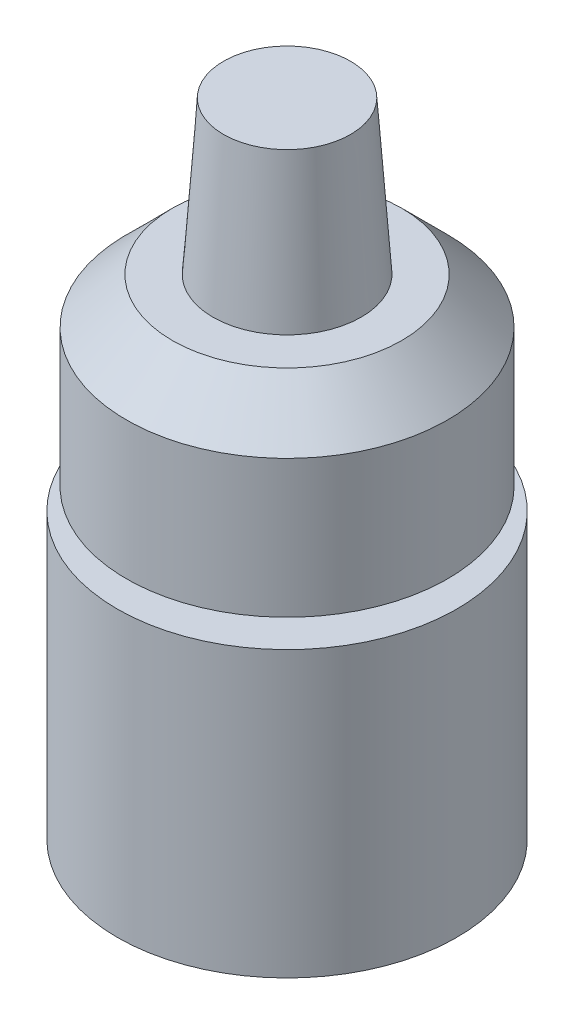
from build123d import *

# Parameters (mm, degrees)
SKETCH_1_R      = 11.11
EXTRUDE_1_DEPTH = 18.6
SKETCH_2_R      = 5.15
EXTRUDE_2_DEPTH = 7.93
SKETCH_3_R      = 3.354560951
EXTRUDE_3_DEPTH = 12.69
SKETCH_4_R      = 10.5
EXTRUDE_4_DEPTH = 12
CHAMFER_1_SIZE  = 3
SKETCH_5_R      = 4.851589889
EXTRUDE_5_DEPTH = 10
EXTRUDE_5_TAPER = 4


with BuildPart() as part:
    # Sketch 1 → Extrude 1 (new body)
    with BuildSketch(Plane(origin=(0, 0, 0), x_dir=(1, 0, 0), z_dir=(0, 1, 0))):
        with Locations(Location((0, 0, 0), (0, 0, 270))):
            Circle(SKETCH_1_R)
    extrude(amount=EXTRUDE_1_DEPTH)

    # Sketch 2 → Extrude 2 (add)
    with BuildSketch(Plane(origin=(0, 18.6, 0), x_dir=(1, 0, 0), z_dir=(0, 1, 0))):
        with Locations(Location((0, 0, 0), (0, 0, 270))):
            Circle(SKETCH_2_R)
    extrude(amount=EXTRUDE_2_DEPTH)

    # Sketch 3 → Extrude 3 (add)
    with BuildSketch(Plane(origin=(0, 26.53, 0), x_dir=(1, 0, 0), z_dir=(0, 1, 0))):
        with Locations(Location((0, 0, 0), (0, 0, 270))):
            Circle(SKETCH_3_R)
    extrude(amount=EXTRUDE_3_DEPTH)

    # Sketch 4 → Extrude 4 (add)
    with BuildSketch(Plane(origin=(0, 20, 0), x_dir=(-1, 0, 0), z_dir=(0, -1, 0))):
        with Locations(Location((0, 0, 0), (0, 0, 90))):
            Circle(SKETCH_4_R)
    extrude(amount=-EXTRUDE_4_DEPTH)

    # Chamfer 1
    chamfer_1_edges = [part.edges().sort_by_distance(p)[0] for p in [
        (0, 32, 10.5),
    ]]
    chamfer(chamfer_1_edges, length=CHAMFER_1_SIZE)

    # Sketch 5 → Extrude 5 (add)
    with BuildSketch(Plane(origin=(0, 32, 0), x_dir=(1, 0, 0), z_dir=(0, 1, 0))):
        Circle(SKETCH_5_R)
    extrude(amount=EXTRUDE_5_DEPTH, taper=EXTRUDE_5_TAPER)


solid = part.part
